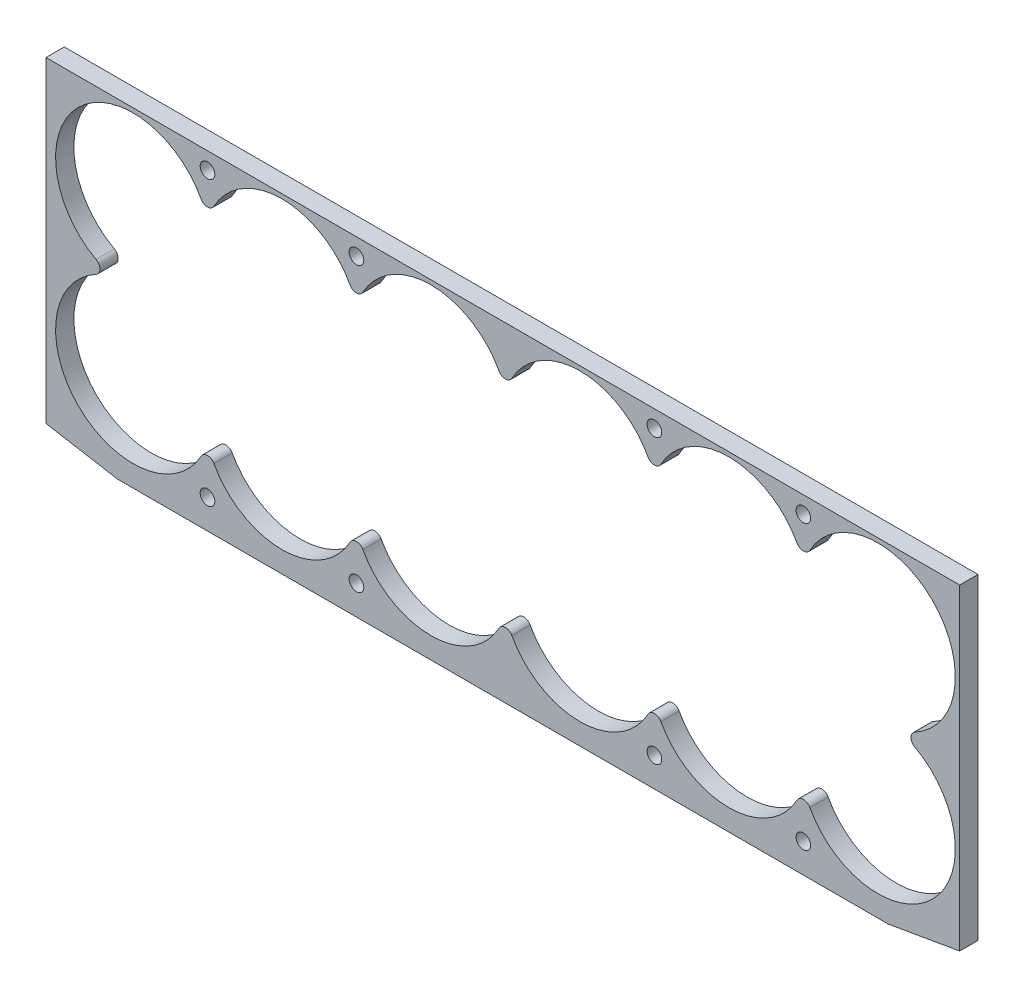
ISO-10303-21;
HEADER;
FILE_DESCRIPTION(('STEP AP214'),'2;1');
FILE_NAME('part.step','',(''),(''),'','','');
FILE_SCHEMA(('AUTOMOTIVE_DESIGN { 1 0 10303 214 1 1 1 1 }'));
ENDSEC;
DATA;
#1=APPLICATION_CONTEXT('core data for automotive mechanical design processes');
#2=APPLICATION_PROTOCOL_DEFINITION('international standard','automotive_design',2000,#1);
#3=PRODUCT_CONTEXT('',#1,'mechanical');
#4=PRODUCT('Part','Part','',(#3));
#5=PRODUCT_RELATED_PRODUCT_CATEGORY('part','',(#4));
#6=PRODUCT_DEFINITION_FORMATION('','',#4);
#7=PRODUCT_DEFINITION_CONTEXT('part definition',#1,'design');
#8=PRODUCT_DEFINITION('design','',#6,#7);
#9=PRODUCT_DEFINITION_SHAPE('','',#8);
#10=(LENGTH_UNIT() NAMED_UNIT(*) SI_UNIT(.MILLI.,.METRE.));
#11=(NAMED_UNIT(*) PLANE_ANGLE_UNIT() SI_UNIT($,.RADIAN.));
#12=(NAMED_UNIT(*) SI_UNIT($,.STERADIAN.) SOLID_ANGLE_UNIT());
#13=UNCERTAINTY_MEASURE_WITH_UNIT(LENGTH_MEASURE(1.E-05),#10,'distance_accuracy_value','');
#14=(GEOMETRIC_REPRESENTATION_CONTEXT(3) GLOBAL_UNCERTAINTY_ASSIGNED_CONTEXT((#13)) GLOBAL_UNIT_ASSIGNED_CONTEXT((#10,
#11,#12)) REPRESENTATION_CONTEXT('',''));
#15=CARTESIAN_POINT('',(0.,0.,0.));
#16=DIRECTION('',(0.,0.,1.));
#17=DIRECTION('',(1.,0.,0.));
#18=AXIS2_PLACEMENT_3D('',#15,#16,#17);
#19=CARTESIAN_POINT('',(0.,0.,3.175));
#20=DIRECTION('',(0.,0.,-1.));
#21=DIRECTION('',(-1.,0.,0.));
#22=AXIS2_PLACEMENT_3D('',#19,#20,#21);
#23=PLANE('',#22);
#24=CARTESIAN_POINT('',(-129.25,-1.66260446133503,3.175));
#25=DIRECTION('',(0.,0.,1.));
#26=DIRECTION('',(1.,0.,0.));
#27=AXIS2_PLACEMENT_3D('',#24,#25,#26);
#28=CIRCLE('',#27,1.27);
#29=CARTESIAN_POINT('',(-127.98,-1.66260446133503,3.175));
#30=VERTEX_POINT('',#29);
#31=EDGE_CURVE('E400',#30,#30,#28,.T.);
#32=ORIENTED_EDGE('',*,*,#31,.F.);
#33=EDGE_LOOP('',(#32));
#34=FACE_BOUND('',#33,.T.);
#35=CARTESIAN_POINT('',(-51.7,-1.66260446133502,3.175));
#36=DIRECTION('',(0.,0.,1.));
#37=DIRECTION('',(1.,0.,0.));
#38=AXIS2_PLACEMENT_3D('',#35,#36,#37);
#39=CIRCLE('',#38,1.27);
#40=CARTESIAN_POINT('',(-50.43,-1.66260446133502,3.175));
#41=VERTEX_POINT('',#40);
#42=EDGE_CURVE('E414',#41,#41,#39,.T.);
#43=ORIENTED_EDGE('',*,*,#42,.F.);
#44=EDGE_LOOP('',(#43));
#45=FACE_BOUND('',#44,.T.);
#46=CARTESIAN_POINT('',(-129.25,-50.8,3.175));
#47=DIRECTION('',(0.,0.,1.));
#48=DIRECTION('',(1.,0.,0.));
#49=AXIS2_PLACEMENT_3D('',#46,#47,#48);
#50=CIRCLE('',#49,1.27);
#51=CARTESIAN_POINT('',(-127.98,-50.8,3.175));
#52=VERTEX_POINT('',#51);
#53=EDGE_CURVE('E426',#52,#52,#50,.T.);
#54=ORIENTED_EDGE('',*,*,#53,.F.);
#55=EDGE_LOOP('',(#54));
#56=FACE_BOUND('',#55,.T.);
#57=CARTESIAN_POINT('',(-51.7,-50.8,3.175));
#58=DIRECTION('',(0.,0.,1.));
#59=DIRECTION('',(1.,0.,0.));
#60=AXIS2_PLACEMENT_3D('',#57,#58,#59);
#61=CIRCLE('',#60,1.27);
#62=CARTESIAN_POINT('',(-50.43,-50.8,3.175));
#63=VERTEX_POINT('',#62);
#64=EDGE_CURVE('E438',#63,#63,#61,.T.);
#65=ORIENTED_EDGE('',*,*,#64,.F.);
#66=EDGE_LOOP('',(#65));
#67=FACE_BOUND('',#66,.T.);
#68=DIRECTION('',(-1.,0.,0.));
#69=VECTOR('',#68,1.);
#70=CARTESIAN_POINT('',(-157.27,1.27,3.175));
#71=LINE('',#70,#69);
#72=CARTESIAN_POINT('',(1.27,1.27,3.175));
#73=VERTEX_POINT('',#72);
#74=CARTESIAN_POINT('',(-157.27,1.27,3.175));
#75=VERTEX_POINT('',#74);
#76=EDGE_CURVE('E242',#73,#75,#71,.T.);
#77=ORIENTED_EDGE('',*,*,#76,.T.);
#78=DIRECTION('',(0.,-1.,0.));
#79=VECTOR('',#78,1.);
#80=CARTESIAN_POINT('',(-157.27,-53.732604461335,3.175));
#81=LINE('',#80,#79);
#82=CARTESIAN_POINT('',(-157.27,-53.732604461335,3.175));
#83=VERTEX_POINT('',#82);
#84=EDGE_CURVE('E231',#75,#83,#81,.T.);
#85=ORIENTED_EDGE('',*,*,#84,.T.);
#86=DIRECTION('',(0.985397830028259,-0.170267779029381,0.));
#87=VECTOR('',#86,1.);
#88=CARTESIAN_POINT('',(-144.842288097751,-55.88,3.175));
#89=LINE('',#88,#87);
#90=CARTESIAN_POINT('',(-144.842288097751,-55.88,3.175));
#91=VERTEX_POINT('',#90);
#92=EDGE_CURVE('E241',#83,#91,#89,.T.);
#93=ORIENTED_EDGE('',*,*,#92,.T.);
#94=DIRECTION('',(1.,0.,0.));
#95=VECTOR('',#94,1.);
#96=CARTESIAN_POINT('',(-11.1577119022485,-55.88,3.175));
#97=LINE('',#96,#95);
#98=CARTESIAN_POINT('',(-11.1577119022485,-55.88,3.175));
#99=VERTEX_POINT('',#98);
#100=EDGE_CURVE('E450',#91,#99,#97,.T.);
#101=ORIENTED_EDGE('',*,*,#100,.T.);
#102=DIRECTION('',(0.985397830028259,0.17026777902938,0.));
#103=VECTOR('',#102,1.);
#104=CARTESIAN_POINT('',(1.27,-53.732604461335,3.175));
#105=LINE('',#104,#103);
#106=CARTESIAN_POINT('',(1.27,-53.732604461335,3.175));
#107=VERTEX_POINT('',#106);
#108=EDGE_CURVE('E452',#99,#107,#105,.T.);
#109=ORIENTED_EDGE('',*,*,#108,.T.);
#110=DIRECTION('',(0.,1.,0.));
#111=VECTOR('',#110,1.);
#112=CARTESIAN_POINT('',(1.27,1.27,3.175));
#113=LINE('',#112,#111);
#114=EDGE_CURVE('E247',#107,#73,#113,.T.);
#115=ORIENTED_EDGE('',*,*,#114,.T.);
#116=EDGE_LOOP('',(#77,#85,#93,#101,#109,#115));
#117=FACE_BOUND('',#116,.T.);
#118=CARTESIAN_POINT('',(-25.85,-50.8,3.175));
#119=DIRECTION('',(0.,0.,1.));
#120=DIRECTION('',(1.,0.,0.));
#121=AXIS2_PLACEMENT_3D('',#118,#119,#120);
#122=CIRCLE('',#121,1.27);
#123=CARTESIAN_POINT('',(-24.58,-50.8,3.175));
#124=VERTEX_POINT('',#123);
#125=EDGE_CURVE('E444',#124,#124,#122,.T.);
#126=ORIENTED_EDGE('',*,*,#125,.F.);
#127=EDGE_LOOP('',(#126));
#128=FACE_BOUND('',#127,.T.);
#129=CARTESIAN_POINT('',(-103.4,-50.8,3.175));
#130=DIRECTION('',(0.,0.,1.));
#131=DIRECTION('',(1.,0.,0.));
#132=AXIS2_PLACEMENT_3D('',#129,#130,#131);
#133=CIRCLE('',#132,1.26999999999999);
#134=CARTESIAN_POINT('',(-102.13,-50.8,3.175));
#135=VERTEX_POINT('',#134);
#136=EDGE_CURVE('E432',#135,#135,#133,.T.);
#137=ORIENTED_EDGE('',*,*,#136,.F.);
#138=EDGE_LOOP('',(#137));
#139=FACE_BOUND('',#138,.T.);
#140=CARTESIAN_POINT('',(-25.85,-1.66260446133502,3.175));
#141=DIRECTION('',(0.,0.,1.));
#142=DIRECTION('',(1.,0.,0.));
#143=AXIS2_PLACEMENT_3D('',#140,#141,#142);
#144=CIRCLE('',#143,1.27);
#145=CARTESIAN_POINT('',(-24.58,-1.66260446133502,3.175));
#146=VERTEX_POINT('',#145);
#147=EDGE_CURVE('E420',#146,#146,#144,.T.);
#148=ORIENTED_EDGE('',*,*,#147,.F.);
#149=EDGE_LOOP('',(#148));
#150=FACE_BOUND('',#149,.T.);
#151=CARTESIAN_POINT('',(-103.4,-1.66260446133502,3.175));
#152=DIRECTION('',(0.,0.,1.));
#153=DIRECTION('',(1.,0.,0.));
#154=AXIS2_PLACEMENT_3D('',#151,#152,#153);
#155=CIRCLE('',#154,1.26999999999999);
#156=CARTESIAN_POINT('',(-102.13,-1.66260446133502,3.175));
#157=VERTEX_POINT('',#156);
#158=EDGE_CURVE('E408',#157,#157,#155,.T.);
#159=ORIENTED_EDGE('',*,*,#158,.F.);
#160=EDGE_LOOP('',(#159));
#161=FACE_BOUND('',#160,.T.);
#162=CARTESIAN_POINT('',(-12.925,-12.925,3.175));
#163=DIRECTION('',(0.,0.,1.));
#164=DIRECTION('',(1.,0.,0.));
#165=AXIS2_PLACEMENT_3D('',#162,#163,#164);
#166=CIRCLE('',#165,13.433);
#167=CARTESIAN_POINT('',(-6.52164382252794,-24.7335781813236,3.175));
#168=VERTEX_POINT('',#167);
#169=CARTESIAN_POINT('',(-24.7335781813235,-6.52164382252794,3.175));
#170=VERTEX_POINT('',#169);
#171=EDGE_CURVE('E881',#168,#170,#166,.T.);
#172=ORIENTED_EDGE('',*,*,#171,.F.);
#173=CARTESIAN_POINT('',(-5.91624946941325,-25.85,3.175));
#174=DIRECTION('',(0.,0.,-1.));
#175=DIRECTION('',(-1.,0.,0.));
#176=AXIS2_PLACEMENT_3D('',#173,#174,#175);
#177=CIRCLE('',#176,1.27);
#178=CARTESIAN_POINT('',(-6.52164382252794,-26.9664218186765,3.175));
#179=VERTEX_POINT('',#178);
#180=EDGE_CURVE('E316',#168,#179,#177,.F.);
#181=ORIENTED_EDGE('',*,*,#180,.T.);
#182=CARTESIAN_POINT('',(-12.925,-38.775,3.175));
#183=DIRECTION('',(0.,0.,1.));
#184=DIRECTION('',(1.,0.,0.));
#185=AXIS2_PLACEMENT_3D('',#182,#183,#184);
#186=CIRCLE('',#185,13.433);
#187=CARTESIAN_POINT('',(-24.7335781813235,-45.1783561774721,3.175));
#188=VERTEX_POINT('',#187);
#189=EDGE_CURVE('E878',#188,#179,#186,.T.);
#190=ORIENTED_EDGE('',*,*,#189,.F.);
#191=CARTESIAN_POINT('',(-25.85,-45.7837505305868,3.175));
#192=DIRECTION('',(0.,0.,-1.));
#193=DIRECTION('',(-1.,0.,0.));
#194=AXIS2_PLACEMENT_3D('',#191,#192,#193);
#195=CIRCLE('',#194,1.27);
#196=CARTESIAN_POINT('',(-26.9664218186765,-45.1783561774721,3.175));
#197=VERTEX_POINT('',#196);
#198=EDGE_CURVE('E295',#188,#197,#195,.F.);
#199=ORIENTED_EDGE('',*,*,#198,.T.);
#200=CARTESIAN_POINT('',(-38.775,-38.775,3.175));
#201=DIRECTION('',(0.,0.,1.));
#202=DIRECTION('',(1.,0.,0.));
#203=AXIS2_PLACEMENT_3D('',#200,#201,#202);
#204=CIRCLE('',#203,13.433);
#205=CARTESIAN_POINT('',(-50.5835781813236,-45.1783561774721,3.175));
#206=VERTEX_POINT('',#205);
#207=EDGE_CURVE('E371',#206,#197,#204,.T.);
#208=ORIENTED_EDGE('',*,*,#207,.F.);
#209=CARTESIAN_POINT('',(-51.7,-45.7837505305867,3.175));
#210=DIRECTION('',(0.,0.,-1.));
#211=DIRECTION('',(-1.,0.,0.));
#212=AXIS2_PLACEMENT_3D('',#209,#210,#211);
#213=CIRCLE('',#212,1.27);
#214=CARTESIAN_POINT('',(-52.8164218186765,-45.1783561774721,3.175));
#215=VERTEX_POINT('',#214);
#216=EDGE_CURVE('E297',#206,#215,#213,.F.);
#217=ORIENTED_EDGE('',*,*,#216,.T.);
#218=CARTESIAN_POINT('',(-64.625,-38.775,3.175));
#219=DIRECTION('',(0.,0.,1.));
#220=DIRECTION('',(1.,0.,0.));
#221=AXIS2_PLACEMENT_3D('',#218,#219,#220);
#222=CIRCLE('',#221,13.433);
#223=CARTESIAN_POINT('',(-76.4335781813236,-45.1783561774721,3.175));
#224=VERTEX_POINT('',#223);
#225=EDGE_CURVE('E886',#224,#215,#222,.T.);
#226=ORIENTED_EDGE('',*,*,#225,.F.);
#227=CARTESIAN_POINT('',(-77.55,-45.7837505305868,3.175));
#228=DIRECTION('',(0.,0.,-1.));
#229=DIRECTION('',(-1.,0.,0.));
#230=AXIS2_PLACEMENT_3D('',#227,#228,#229);
#231=CIRCLE('',#230,1.27);
#232=CARTESIAN_POINT('',(-78.6664218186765,-45.1783561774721,3.175));
#233=VERTEX_POINT('',#232);
#234=EDGE_CURVE('E299',#224,#233,#231,.F.);
#235=ORIENTED_EDGE('',*,*,#234,.T.);
#236=CARTESIAN_POINT('',(-90.475,-38.775,3.175));
#237=DIRECTION('',(0.,0.,1.));
#238=DIRECTION('',(1.,0.,0.));
#239=AXIS2_PLACEMENT_3D('',#236,#237,#238);
#240=CIRCLE('',#239,13.433);
#241=CARTESIAN_POINT('',(-102.283578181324,-45.178356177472,3.175));
#242=VERTEX_POINT('',#241);
#243=EDGE_CURVE('E921',#242,#233,#240,.T.);
#244=ORIENTED_EDGE('',*,*,#243,.F.);
#245=CARTESIAN_POINT('',(-103.4,-45.7837505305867,3.175));
#246=DIRECTION('',(0.,0.,-1.));
#247=DIRECTION('',(-1.,0.,0.));
#248=AXIS2_PLACEMENT_3D('',#245,#246,#247);
#249=CIRCLE('',#248,1.27);
#250=CARTESIAN_POINT('',(-104.516421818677,-45.178356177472,3.175));
#251=VERTEX_POINT('',#250);
#252=EDGE_CURVE('E301',#242,#251,#249,.F.);
#253=ORIENTED_EDGE('',*,*,#252,.T.);
#254=CARTESIAN_POINT('',(-116.325,-38.775,3.175));
#255=DIRECTION('',(0.,0.,1.));
#256=DIRECTION('',(1.,0.,0.));
#257=AXIS2_PLACEMENT_3D('',#254,#255,#256);
#258=CIRCLE('',#257,13.433);
#259=CARTESIAN_POINT('',(-128.133578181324,-45.178356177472,3.175));
#260=VERTEX_POINT('',#259);
#261=EDGE_CURVE('E919',#260,#251,#258,.T.);
#262=ORIENTED_EDGE('',*,*,#261,.F.);
#263=CARTESIAN_POINT('',(-129.25,-45.7837505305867,3.175));
#264=DIRECTION('',(0.,0.,-1.));
#265=DIRECTION('',(-1.,0.,0.));
#266=AXIS2_PLACEMENT_3D('',#263,#264,#265);
#267=CIRCLE('',#266,1.27);
#268=CARTESIAN_POINT('',(-130.366421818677,-45.178356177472,3.175));
#269=VERTEX_POINT('',#268);
#270=EDGE_CURVE('E303',#260,#269,#267,.F.);
#271=ORIENTED_EDGE('',*,*,#270,.T.);
#272=CARTESIAN_POINT('',(-142.175,-38.775,3.175));
#273=DIRECTION('',(0.,0.,1.));
#274=DIRECTION('',(1.,0.,0.));
#275=AXIS2_PLACEMENT_3D('',#272,#273,#274);
#276=CIRCLE('',#275,13.433);
#277=CARTESIAN_POINT('',(-148.578356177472,-26.9664218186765,3.175));
#278=VERTEX_POINT('',#277);
#279=EDGE_CURVE('E924',#278,#269,#276,.T.);
#280=ORIENTED_EDGE('',*,*,#279,.F.);
#281=CARTESIAN_POINT('',(-149.183750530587,-25.85,3.175));
#282=DIRECTION('',(0.,0.,-1.));
#283=DIRECTION('',(-1.,0.,0.));
#284=AXIS2_PLACEMENT_3D('',#281,#282,#283);
#285=CIRCLE('',#284,1.27);
#286=CARTESIAN_POINT('',(-148.578356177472,-24.7335781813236,3.175));
#287=VERTEX_POINT('',#286);
#288=EDGE_CURVE('E48',#278,#287,#285,.F.);
#289=ORIENTED_EDGE('',*,*,#288,.T.);
#290=CARTESIAN_POINT('',(-142.175,-12.925,3.175));
#291=DIRECTION('',(0.,0.,1.));
#292=DIRECTION('',(1.,0.,0.));
#293=AXIS2_PLACEMENT_3D('',#290,#291,#292);
#294=CIRCLE('',#293,13.433);
#295=CARTESIAN_POINT('',(-130.366421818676,-6.5216438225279,3.175));
#296=VERTEX_POINT('',#295);
#297=EDGE_CURVE('E928',#296,#287,#294,.T.);
#298=ORIENTED_EDGE('',*,*,#297,.F.);
#299=CARTESIAN_POINT('',(-129.25,-5.91624946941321,3.175));
#300=DIRECTION('',(0.,0.,-1.));
#301=DIRECTION('',(-1.,0.,0.));
#302=AXIS2_PLACEMENT_3D('',#299,#300,#301);
#303=CIRCLE('',#302,1.27);
#304=CARTESIAN_POINT('',(-128.133578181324,-6.52164382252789,3.175));
#305=VERTEX_POINT('',#304);
#306=EDGE_CURVE('E306',#296,#305,#303,.F.);
#307=ORIENTED_EDGE('',*,*,#306,.T.);
#308=CARTESIAN_POINT('',(-116.325,-12.925,3.175));
#309=DIRECTION('',(0.,0.,1.));
#310=DIRECTION('',(1.,0.,0.));
#311=AXIS2_PLACEMENT_3D('',#308,#309,#310);
#312=CIRCLE('',#311,13.433);
#313=CARTESIAN_POINT('',(-104.516421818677,-6.52164382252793,3.175));
#314=VERTEX_POINT('',#313);
#315=EDGE_CURVE('E399',#314,#305,#312,.T.);
#316=ORIENTED_EDGE('',*,*,#315,.F.);
#317=CARTESIAN_POINT('',(-103.4,-5.91624946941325,3.175));
#318=DIRECTION('',(0.,0.,-1.));
#319=DIRECTION('',(-1.,0.,0.));
#320=AXIS2_PLACEMENT_3D('',#317,#318,#319);
#321=CIRCLE('',#320,1.27);
#322=CARTESIAN_POINT('',(-102.283578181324,-6.52164382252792,3.175));
#323=VERTEX_POINT('',#322);
#324=EDGE_CURVE('E308',#314,#323,#321,.F.);
#325=ORIENTED_EDGE('',*,*,#324,.T.);
#326=CARTESIAN_POINT('',(-90.475,-12.925,3.175));
#327=DIRECTION('',(0.,0.,1.));
#328=DIRECTION('',(1.,0.,0.));
#329=AXIS2_PLACEMENT_3D('',#326,#327,#328);
#330=CIRCLE('',#329,13.433);
#331=CARTESIAN_POINT('',(-78.6664218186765,-6.52164382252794,3.175));
#332=VERTEX_POINT('',#331);
#333=EDGE_CURVE('E407',#332,#323,#330,.T.);
#334=ORIENTED_EDGE('',*,*,#333,.F.);
#335=CARTESIAN_POINT('',(-77.55,-5.91624946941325,3.175));
#336=DIRECTION('',(0.,0.,-1.));
#337=DIRECTION('',(-1.,0.,0.));
#338=AXIS2_PLACEMENT_3D('',#335,#336,#337);
#339=CIRCLE('',#338,1.27);
#340=CARTESIAN_POINT('',(-76.4335781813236,-6.52164382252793,3.175));
#341=VERTEX_POINT('',#340);
#342=EDGE_CURVE('E310',#332,#341,#339,.F.);
#343=ORIENTED_EDGE('',*,*,#342,.T.);
#344=CARTESIAN_POINT('',(-64.625,-12.925,3.175));
#345=DIRECTION('',(0.,0.,1.));
#346=DIRECTION('',(1.,0.,0.));
#347=AXIS2_PLACEMENT_3D('',#344,#345,#346);
#348=CIRCLE('',#347,13.433);
#349=CARTESIAN_POINT('',(-52.8164218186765,-6.52164382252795,3.175));
#350=VERTEX_POINT('',#349);
#351=EDGE_CURVE('E892',#350,#341,#348,.T.);
#352=ORIENTED_EDGE('',*,*,#351,.F.);
#353=CARTESIAN_POINT('',(-51.7,-5.91624946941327,3.175));
#354=DIRECTION('',(0.,0.,-1.));
#355=DIRECTION('',(-1.,0.,0.));
#356=AXIS2_PLACEMENT_3D('',#353,#354,#355);
#357=CIRCLE('',#356,1.27);
#358=CARTESIAN_POINT('',(-50.5835781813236,-6.52164382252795,3.175));
#359=VERTEX_POINT('',#358);
#360=EDGE_CURVE('E312',#350,#359,#357,.F.);
#361=ORIENTED_EDGE('',*,*,#360,.T.);
#362=CARTESIAN_POINT('',(-38.775,-12.925,3.175));
#363=DIRECTION('',(0.,0.,1.));
#364=DIRECTION('',(1.,0.,0.));
#365=AXIS2_PLACEMENT_3D('',#362,#363,#364);
#366=CIRCLE('',#365,13.433);
#367=CARTESIAN_POINT('',(-26.9664218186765,-6.52164382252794,3.175));
#368=VERTEX_POINT('',#367);
#369=EDGE_CURVE('E884',#368,#359,#366,.T.);
#370=ORIENTED_EDGE('',*,*,#369,.F.);
#371=CARTESIAN_POINT('',(-25.85,-5.91624946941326,3.175));
#372=DIRECTION('',(0.,0.,-1.));
#373=DIRECTION('',(-1.,0.,0.));
#374=AXIS2_PLACEMENT_3D('',#371,#372,#373);
#375=CIRCLE('',#374,1.27);
#376=EDGE_CURVE('E314',#368,#170,#375,.F.);
#377=ORIENTED_EDGE('',*,*,#376,.T.);
#378=EDGE_LOOP('',(#172,#181,#190,#199,#208,#217,#226,#235,#244,#253,#262,#271,#280,#289,#298,
#307,#316,#325,#334,#343,#352,#361,#370,#377));
#379=FACE_BOUND('',#378,.T.);
#380=ADVANCED_FACE('F33',(#34,#45,#56,#67,#117,#128,#139,#150,#161,#379),#23,.F.);
#381=CARTESIAN_POINT('',(0.,0.,0.));
#382=DIRECTION('',(0.,0.,-1.));
#383=DIRECTION('',(-1.,0.,0.));
#384=AXIS2_PLACEMENT_3D('',#381,#382,#383);
#385=PLANE('',#384);
#386=CARTESIAN_POINT('',(-129.25,-1.66260446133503,0.));
#387=DIRECTION('',(0.,0.,1.));
#388=DIRECTION('',(1.,0.,0.));
#389=AXIS2_PLACEMENT_3D('',#386,#387,#388);
#390=CIRCLE('',#389,1.27);
#391=CARTESIAN_POINT('',(-127.98,-1.66260446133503,0.));
#392=VERTEX_POINT('',#391);
#393=EDGE_CURVE('E404',#392,#392,#390,.T.);
#394=ORIENTED_EDGE('',*,*,#393,.T.);
#395=EDGE_LOOP('',(#394));
#396=FACE_BOUND('',#395,.T.);
#397=CARTESIAN_POINT('',(-51.7,-1.66260446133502,0.));
#398=DIRECTION('',(0.,0.,1.));
#399=DIRECTION('',(1.,0.,0.));
#400=AXIS2_PLACEMENT_3D('',#397,#398,#399);
#401=CIRCLE('',#400,1.27);
#402=CARTESIAN_POINT('',(-50.43,-1.66260446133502,0.));
#403=VERTEX_POINT('',#402);
#404=EDGE_CURVE('E411',#403,#403,#401,.T.);
#405=ORIENTED_EDGE('',*,*,#404,.T.);
#406=EDGE_LOOP('',(#405));
#407=FACE_BOUND('',#406,.T.);
#408=CARTESIAN_POINT('',(-129.25,-50.8,0.));
#409=DIRECTION('',(0.,0.,1.));
#410=DIRECTION('',(1.,0.,0.));
#411=AXIS2_PLACEMENT_3D('',#408,#409,#410);
#412=CIRCLE('',#411,1.27);
#413=CARTESIAN_POINT('',(-127.98,-50.8,0.));
#414=VERTEX_POINT('',#413);
#415=EDGE_CURVE('E423',#414,#414,#412,.T.);
#416=ORIENTED_EDGE('',*,*,#415,.T.);
#417=EDGE_LOOP('',(#416));
#418=FACE_BOUND('',#417,.T.);
#419=CARTESIAN_POINT('',(-51.7,-50.8,0.));
#420=DIRECTION('',(0.,0.,1.));
#421=DIRECTION('',(1.,0.,0.));
#422=AXIS2_PLACEMENT_3D('',#419,#420,#421);
#423=CIRCLE('',#422,1.27);
#424=CARTESIAN_POINT('',(-50.43,-50.8,0.));
#425=VERTEX_POINT('',#424);
#426=EDGE_CURVE('E435',#425,#425,#423,.T.);
#427=ORIENTED_EDGE('',*,*,#426,.T.);
#428=EDGE_LOOP('',(#427));
#429=FACE_BOUND('',#428,.T.);
#430=DIRECTION('',(-1.,0.,0.));
#431=VECTOR('',#430,1.);
#432=CARTESIAN_POINT('',(-157.27,1.27,0.));
#433=LINE('',#432,#431);
#434=CARTESIAN_POINT('',(1.27,1.27,0.));
#435=VERTEX_POINT('',#434);
#436=CARTESIAN_POINT('',(-157.27,1.27,0.));
#437=VERTEX_POINT('',#436);
#438=EDGE_CURVE('E255',#435,#437,#433,.T.);
#439=ORIENTED_EDGE('',*,*,#438,.F.);
#440=DIRECTION('',(0.,1.,0.));
#441=VECTOR('',#440,1.);
#442=CARTESIAN_POINT('',(1.27,1.27,0.));
#443=LINE('',#442,#441);
#444=CARTESIAN_POINT('',(1.27,-53.732604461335,0.));
#445=VERTEX_POINT('',#444);
#446=EDGE_CURVE('E251',#445,#435,#443,.T.);
#447=ORIENTED_EDGE('',*,*,#446,.F.);
#448=DIRECTION('',(0.985397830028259,0.17026777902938,0.));
#449=VECTOR('',#448,1.);
#450=CARTESIAN_POINT('',(1.27,-53.732604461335,0.));
#451=LINE('',#450,#449);
#452=CARTESIAN_POINT('',(-11.1577119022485,-55.88,0.));
#453=VERTEX_POINT('',#452);
#454=EDGE_CURVE('E463',#453,#445,#451,.T.);
#455=ORIENTED_EDGE('',*,*,#454,.F.);
#456=DIRECTION('',(1.,0.,0.));
#457=VECTOR('',#456,1.);
#458=CARTESIAN_POINT('',(-11.1577119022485,-55.88,0.));
#459=LINE('',#458,#457);
#460=CARTESIAN_POINT('',(-144.842288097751,-55.88,0.));
#461=VERTEX_POINT('',#460);
#462=EDGE_CURVE('E461',#461,#453,#459,.T.);
#463=ORIENTED_EDGE('',*,*,#462,.F.);
#464=DIRECTION('',(0.985397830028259,-0.170267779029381,0.));
#465=VECTOR('',#464,1.);
#466=CARTESIAN_POINT('',(-144.842288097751,-55.88,0.));
#467=LINE('',#466,#465);
#468=CARTESIAN_POINT('',(-157.27,-53.732604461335,0.));
#469=VERTEX_POINT('',#468);
#470=EDGE_CURVE('E459',#469,#461,#467,.T.);
#471=ORIENTED_EDGE('',*,*,#470,.F.);
#472=DIRECTION('',(0.,-1.,0.));
#473=VECTOR('',#472,1.);
#474=CARTESIAN_POINT('',(-157.27,-53.732604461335,0.));
#475=LINE('',#474,#473);
#476=EDGE_CURVE('E457',#437,#469,#475,.T.);
#477=ORIENTED_EDGE('',*,*,#476,.F.);
#478=EDGE_LOOP('',(#439,#447,#455,#463,#471,#477));
#479=FACE_BOUND('',#478,.T.);
#480=CARTESIAN_POINT('',(-25.85,-50.8,0.));
#481=DIRECTION('',(0.,0.,1.));
#482=DIRECTION('',(1.,0.,0.));
#483=AXIS2_PLACEMENT_3D('',#480,#481,#482);
#484=CIRCLE('',#483,1.27);
#485=CARTESIAN_POINT('',(-24.58,-50.8,0.));
#486=VERTEX_POINT('',#485);
#487=EDGE_CURVE('E441',#486,#486,#484,.T.);
#488=ORIENTED_EDGE('',*,*,#487,.T.);
#489=EDGE_LOOP('',(#488));
#490=FACE_BOUND('',#489,.T.);
#491=CARTESIAN_POINT('',(-103.4,-50.8,0.));
#492=DIRECTION('',(0.,0.,1.));
#493=DIRECTION('',(1.,0.,0.));
#494=AXIS2_PLACEMENT_3D('',#491,#492,#493);
#495=CIRCLE('',#494,1.26999999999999);
#496=CARTESIAN_POINT('',(-102.13,-50.8,0.));
#497=VERTEX_POINT('',#496);
#498=EDGE_CURVE('E429',#497,#497,#495,.T.);
#499=ORIENTED_EDGE('',*,*,#498,.T.);
#500=EDGE_LOOP('',(#499));
#501=FACE_BOUND('',#500,.T.);
#502=CARTESIAN_POINT('',(-25.85,-1.66260446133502,0.));
#503=DIRECTION('',(0.,0.,1.));
#504=DIRECTION('',(1.,0.,0.));
#505=AXIS2_PLACEMENT_3D('',#502,#503,#504);
#506=CIRCLE('',#505,1.27);
#507=CARTESIAN_POINT('',(-24.58,-1.66260446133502,0.));
#508=VERTEX_POINT('',#507);
#509=EDGE_CURVE('E417',#508,#508,#506,.T.);
#510=ORIENTED_EDGE('',*,*,#509,.T.);
#511=EDGE_LOOP('',(#510));
#512=FACE_BOUND('',#511,.T.);
#513=CARTESIAN_POINT('',(-103.4,-1.66260446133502,0.));
#514=DIRECTION('',(0.,0.,1.));
#515=DIRECTION('',(1.,0.,0.));
#516=AXIS2_PLACEMENT_3D('',#513,#514,#515);
#517=CIRCLE('',#516,1.26999999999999);
#518=CARTESIAN_POINT('',(-102.13,-1.66260446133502,0.));
#519=VERTEX_POINT('',#518);
#520=EDGE_CURVE('E403',#519,#519,#517,.T.);
#521=ORIENTED_EDGE('',*,*,#520,.T.);
#522=EDGE_LOOP('',(#521));
#523=FACE_BOUND('',#522,.T.);
#524=CARTESIAN_POINT('',(-12.925,-38.775,0.));
#525=DIRECTION('',(0.,0.,1.));
#526=DIRECTION('',(1.,0.,0.));
#527=AXIS2_PLACEMENT_3D('',#524,#525,#526);
#528=CIRCLE('',#527,13.433);
#529=CARTESIAN_POINT('',(-24.7335781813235,-45.1783561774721,0.));
#530=VERTEX_POINT('',#529);
#531=CARTESIAN_POINT('',(-6.52164382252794,-26.9664218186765,0.));
#532=VERTEX_POINT('',#531);
#533=EDGE_CURVE('E379',#530,#532,#528,.T.);
#534=ORIENTED_EDGE('',*,*,#533,.T.);
#535=CARTESIAN_POINT('',(-5.91624946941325,-25.85,0.));
#536=DIRECTION('',(0.,0.,-1.));
#537=DIRECTION('',(-1.,0.,0.));
#538=AXIS2_PLACEMENT_3D('',#535,#536,#537);
#539=CIRCLE('',#538,1.27);
#540=CARTESIAN_POINT('',(-6.52164382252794,-24.7335781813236,0.));
#541=VERTEX_POINT('',#540);
#542=EDGE_CURVE('E288',#532,#541,#539,.T.);
#543=ORIENTED_EDGE('',*,*,#542,.T.);
#544=CARTESIAN_POINT('',(-12.925,-12.925,0.));
#545=DIRECTION('',(0.,0.,1.));
#546=DIRECTION('',(1.,0.,0.));
#547=AXIS2_PLACEMENT_3D('',#544,#545,#546);
#548=CIRCLE('',#547,13.433);
#549=CARTESIAN_POINT('',(-24.7335781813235,-6.52164382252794,0.));
#550=VERTEX_POINT('',#549);
#551=EDGE_CURVE('E382',#541,#550,#548,.T.);
#552=ORIENTED_EDGE('',*,*,#551,.T.);
#553=CARTESIAN_POINT('',(-25.85,-5.91624946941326,0.));
#554=DIRECTION('',(0.,0.,-1.));
#555=DIRECTION('',(-1.,0.,0.));
#556=AXIS2_PLACEMENT_3D('',#553,#554,#555);
#557=CIRCLE('',#556,1.27);
#558=CARTESIAN_POINT('',(-26.9664218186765,-6.52164382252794,0.));
#559=VERTEX_POINT('',#558);
#560=EDGE_CURVE('E286',#550,#559,#557,.T.);
#561=ORIENTED_EDGE('',*,*,#560,.T.);
#562=CARTESIAN_POINT('',(-38.775,-12.925,0.));
#563=DIRECTION('',(0.,0.,1.));
#564=DIRECTION('',(1.,0.,0.));
#565=AXIS2_PLACEMENT_3D('',#562,#563,#564);
#566=CIRCLE('',#565,13.433);
#567=CARTESIAN_POINT('',(-50.5835781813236,-6.52164382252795,0.));
#568=VERTEX_POINT('',#567);
#569=EDGE_CURVE('E390',#559,#568,#566,.T.);
#570=ORIENTED_EDGE('',*,*,#569,.T.);
#571=CARTESIAN_POINT('',(-51.7,-5.91624946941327,0.));
#572=DIRECTION('',(0.,0.,-1.));
#573=DIRECTION('',(-1.,0.,0.));
#574=AXIS2_PLACEMENT_3D('',#571,#572,#573);
#575=CIRCLE('',#574,1.27);
#576=CARTESIAN_POINT('',(-52.8164218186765,-6.52164382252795,0.));
#577=VERTEX_POINT('',#576);
#578=EDGE_CURVE('E284',#568,#577,#575,.T.);
#579=ORIENTED_EDGE('',*,*,#578,.T.);
#580=CARTESIAN_POINT('',(-64.625,-12.925,0.));
#581=DIRECTION('',(0.,0.,1.));
#582=DIRECTION('',(1.,0.,0.));
#583=AXIS2_PLACEMENT_3D('',#580,#581,#582);
#584=CIRCLE('',#583,13.433);
#585=CARTESIAN_POINT('',(-76.4335781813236,-6.52164382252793,0.));
#586=VERTEX_POINT('',#585);
#587=EDGE_CURVE('E393',#577,#586,#584,.T.);
#588=ORIENTED_EDGE('',*,*,#587,.T.);
#589=CARTESIAN_POINT('',(-77.55,-5.91624946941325,0.));
#590=DIRECTION('',(0.,0.,-1.));
#591=DIRECTION('',(-1.,0.,0.));
#592=AXIS2_PLACEMENT_3D('',#589,#590,#591);
#593=CIRCLE('',#592,1.27);
#594=CARTESIAN_POINT('',(-78.6664218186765,-6.52164382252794,0.));
#595=VERTEX_POINT('',#594);
#596=EDGE_CURVE('E282',#586,#595,#593,.T.);
#597=ORIENTED_EDGE('',*,*,#596,.T.);
#598=CARTESIAN_POINT('',(-90.475,-12.925,0.));
#599=DIRECTION('',(0.,0.,1.));
#600=DIRECTION('',(1.,0.,0.));
#601=AXIS2_PLACEMENT_3D('',#598,#599,#600);
#602=CIRCLE('',#601,13.433);
#603=CARTESIAN_POINT('',(-102.283578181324,-6.52164382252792,0.));
#604=VERTEX_POINT('',#603);
#605=EDGE_CURVE('E396',#595,#604,#602,.T.);
#606=ORIENTED_EDGE('',*,*,#605,.T.);
#607=CARTESIAN_POINT('',(-103.4,-5.91624946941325,0.));
#608=DIRECTION('',(0.,0.,-1.));
#609=DIRECTION('',(-1.,0.,0.));
#610=AXIS2_PLACEMENT_3D('',#607,#608,#609);
#611=CIRCLE('',#610,1.27);
#612=CARTESIAN_POINT('',(-104.516421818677,-6.52164382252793,0.));
#613=VERTEX_POINT('',#612);
#614=EDGE_CURVE('E280',#604,#613,#611,.T.);
#615=ORIENTED_EDGE('',*,*,#614,.T.);
#616=CARTESIAN_POINT('',(-116.325,-12.925,0.));
#617=DIRECTION('',(0.,0.,1.));
#618=DIRECTION('',(1.,0.,0.));
#619=AXIS2_PLACEMENT_3D('',#616,#617,#618);
#620=CIRCLE('',#619,13.433);
#621=CARTESIAN_POINT('',(-128.133578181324,-6.52164382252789,0.));
#622=VERTEX_POINT('',#621);
#623=EDGE_CURVE('E897',#613,#622,#620,.T.);
#624=ORIENTED_EDGE('',*,*,#623,.T.);
#625=CARTESIAN_POINT('',(-129.25,-5.91624946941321,0.));
#626=DIRECTION('',(0.,0.,-1.));
#627=DIRECTION('',(-1.,0.,0.));
#628=AXIS2_PLACEMENT_3D('',#625,#626,#627);
#629=CIRCLE('',#628,1.27);
#630=CARTESIAN_POINT('',(-130.366421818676,-6.5216438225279,0.));
#631=VERTEX_POINT('',#630);
#632=EDGE_CURVE('E278',#622,#631,#629,.T.);
#633=ORIENTED_EDGE('',*,*,#632,.T.);
#634=CARTESIAN_POINT('',(-142.175,-12.925,0.));
#635=DIRECTION('',(0.,0.,1.));
#636=DIRECTION('',(1.,0.,0.));
#637=AXIS2_PLACEMENT_3D('',#634,#635,#636);
#638=CIRCLE('',#637,13.433);
#639=CARTESIAN_POINT('',(-148.578356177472,-24.7335781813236,0.));
#640=VERTEX_POINT('',#639);
#641=EDGE_CURVE('E900',#631,#640,#638,.T.);
#642=ORIENTED_EDGE('',*,*,#641,.T.);
#643=CARTESIAN_POINT('',(-149.183750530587,-25.85,0.));
#644=DIRECTION('',(0.,0.,-1.));
#645=DIRECTION('',(-1.,0.,0.));
#646=AXIS2_PLACEMENT_3D('',#643,#644,#645);
#647=CIRCLE('',#646,1.27);
#648=CARTESIAN_POINT('',(-148.578356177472,-26.9664218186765,0.));
#649=VERTEX_POINT('',#648);
#650=EDGE_CURVE('E276',#640,#649,#647,.T.);
#651=ORIENTED_EDGE('',*,*,#650,.T.);
#652=CARTESIAN_POINT('',(-142.175,-38.775,0.));
#653=DIRECTION('',(0.,0.,1.));
#654=DIRECTION('',(1.,0.,0.));
#655=AXIS2_PLACEMENT_3D('',#652,#653,#654);
#656=CIRCLE('',#655,13.433);
#657=CARTESIAN_POINT('',(-130.366421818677,-45.178356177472,0.));
#658=VERTEX_POINT('',#657);
#659=EDGE_CURVE('E903',#649,#658,#656,.T.);
#660=ORIENTED_EDGE('',*,*,#659,.T.);
#661=CARTESIAN_POINT('',(-129.25,-45.7837505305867,0.));
#662=DIRECTION('',(0.,0.,-1.));
#663=DIRECTION('',(-1.,0.,0.));
#664=AXIS2_PLACEMENT_3D('',#661,#662,#663);
#665=CIRCLE('',#664,1.27);
#666=CARTESIAN_POINT('',(-128.133578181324,-45.178356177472,0.));
#667=VERTEX_POINT('',#666);
#668=EDGE_CURVE('E274',#658,#667,#665,.T.);
#669=ORIENTED_EDGE('',*,*,#668,.T.);
#670=CARTESIAN_POINT('',(-116.325,-38.775,0.));
#671=DIRECTION('',(0.,0.,1.));
#672=DIRECTION('',(1.,0.,0.));
#673=AXIS2_PLACEMENT_3D('',#670,#671,#672);
#674=CIRCLE('',#673,13.433);
#675=CARTESIAN_POINT('',(-104.516421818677,-45.178356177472,0.));
#676=VERTEX_POINT('',#675);
#677=EDGE_CURVE('E906',#667,#676,#674,.T.);
#678=ORIENTED_EDGE('',*,*,#677,.T.);
#679=CARTESIAN_POINT('',(-103.4,-45.7837505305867,0.));
#680=DIRECTION('',(0.,0.,-1.));
#681=DIRECTION('',(-1.,0.,0.));
#682=AXIS2_PLACEMENT_3D('',#679,#680,#681);
#683=CIRCLE('',#682,1.27);
#684=CARTESIAN_POINT('',(-102.283578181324,-45.178356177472,0.));
#685=VERTEX_POINT('',#684);
#686=EDGE_CURVE('E272',#676,#685,#683,.T.);
#687=ORIENTED_EDGE('',*,*,#686,.T.);
#688=CARTESIAN_POINT('',(-90.475,-38.775,0.));
#689=DIRECTION('',(0.,0.,1.));
#690=DIRECTION('',(1.,0.,0.));
#691=AXIS2_PLACEMENT_3D('',#688,#689,#690);
#692=CIRCLE('',#691,13.433);
#693=CARTESIAN_POINT('',(-78.6664218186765,-45.1783561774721,0.));
#694=VERTEX_POINT('',#693);
#695=EDGE_CURVE('E384',#685,#694,#692,.T.);
#696=ORIENTED_EDGE('',*,*,#695,.T.);
#697=CARTESIAN_POINT('',(-77.55,-45.7837505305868,0.));
#698=DIRECTION('',(0.,0.,-1.));
#699=DIRECTION('',(-1.,0.,0.));
#700=AXIS2_PLACEMENT_3D('',#697,#698,#699);
#701=CIRCLE('',#700,1.27);
#702=CARTESIAN_POINT('',(-76.4335781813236,-45.1783561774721,0.));
#703=VERTEX_POINT('',#702);
#704=EDGE_CURVE('E270',#694,#703,#701,.T.);
#705=ORIENTED_EDGE('',*,*,#704,.T.);
#706=CARTESIAN_POINT('',(-64.625,-38.775,0.));
#707=DIRECTION('',(0.,0.,1.));
#708=DIRECTION('',(1.,0.,0.));
#709=AXIS2_PLACEMENT_3D('',#706,#707,#708);
#710=CIRCLE('',#709,13.433);
#711=CARTESIAN_POINT('',(-52.8164218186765,-45.1783561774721,0.));
#712=VERTEX_POINT('',#711);
#713=EDGE_CURVE('E380',#703,#712,#710,.T.);
#714=ORIENTED_EDGE('',*,*,#713,.T.);
#715=CARTESIAN_POINT('',(-51.7,-45.7837505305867,0.));
#716=DIRECTION('',(0.,0.,-1.));
#717=DIRECTION('',(-1.,0.,0.));
#718=AXIS2_PLACEMENT_3D('',#715,#716,#717);
#719=CIRCLE('',#718,1.27);
#720=CARTESIAN_POINT('',(-50.5835781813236,-45.1783561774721,0.));
#721=VERTEX_POINT('',#720);
#722=EDGE_CURVE('E268',#712,#721,#719,.T.);
#723=ORIENTED_EDGE('',*,*,#722,.T.);
#724=CARTESIAN_POINT('',(-38.775,-38.775,0.));
#725=DIRECTION('',(0.,0.,1.));
#726=DIRECTION('',(1.,0.,0.));
#727=AXIS2_PLACEMENT_3D('',#724,#725,#726);
#728=CIRCLE('',#727,13.433);
#729=CARTESIAN_POINT('',(-26.9664218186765,-45.1783561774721,0.));
#730=VERTEX_POINT('',#729);
#731=EDGE_CURVE('E368',#721,#730,#728,.T.);
#732=ORIENTED_EDGE('',*,*,#731,.T.);
#733=CARTESIAN_POINT('',(-25.85,-45.7837505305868,0.));
#734=DIRECTION('',(0.,0.,-1.));
#735=DIRECTION('',(-1.,0.,0.));
#736=AXIS2_PLACEMENT_3D('',#733,#734,#735);
#737=CIRCLE('',#736,1.27);
#738=EDGE_CURVE('E266',#730,#530,#737,.T.);
#739=ORIENTED_EDGE('',*,*,#738,.T.);
#740=EDGE_LOOP('',(#534,#543,#552,#561,#570,#579,#588,#597,#606,#615,#624,#633,#642,#651,#660,
#669,#678,#687,#696,#705,#714,#723,#732,#739));
#741=FACE_BOUND('',#740,.T.);
#742=ADVANCED_FACE('F376',(#396,#407,#418,#429,#479,#490,#501,#512,#523,#741),#385,.T.);
#743=CARTESIAN_POINT('',(-157.27,1.27,3.175));
#744=DIRECTION('',(0.,-1.,0.));
#745=DIRECTION('',(0.,0.,-1.));
#746=AXIS2_PLACEMENT_3D('',#743,#744,#745);
#747=PLANE('',#746);
#748=ORIENTED_EDGE('',*,*,#438,.T.);
#749=DIRECTION('',(0.,0.,-1.));
#750=VECTOR('',#749,1.);
#751=CARTESIAN_POINT('',(-157.27,1.27,3.175));
#752=LINE('',#751,#750);
#753=EDGE_CURVE('E235',#75,#437,#752,.T.);
#754=ORIENTED_EDGE('',*,*,#753,.F.);
#755=ORIENTED_EDGE('',*,*,#76,.F.);
#756=DIRECTION('',(0.,0.,-1.));
#757=VECTOR('',#756,1.);
#758=CARTESIAN_POINT('',(1.27,1.27,3.175));
#759=LINE('',#758,#757);
#760=EDGE_CURVE('E455',#73,#435,#759,.T.);
#761=ORIENTED_EDGE('',*,*,#760,.T.);
#762=EDGE_LOOP('',(#748,#754,#755,#761));
#763=FACE_BOUND('',#762,.T.);
#764=ADVANCED_FACE('F253',(#763),#747,.F.);
#765=CARTESIAN_POINT('',(-157.27,-53.732604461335,3.175));
#766=DIRECTION('',(1.,0.,0.));
#767=DIRECTION('',(0.,0.,-1.));
#768=AXIS2_PLACEMENT_3D('',#765,#766,#767);
#769=PLANE('',#768);
#770=ORIENTED_EDGE('',*,*,#476,.T.);
#771=DIRECTION('',(0.,0.,-1.));
#772=VECTOR('',#771,1.);
#773=CARTESIAN_POINT('',(-157.27,-53.732604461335,3.175));
#774=LINE('',#773,#772);
#775=EDGE_CURVE('E238',#83,#469,#774,.T.);
#776=ORIENTED_EDGE('',*,*,#775,.F.);
#777=ORIENTED_EDGE('',*,*,#84,.F.);
#778=ORIENTED_EDGE('',*,*,#753,.T.);
#779=EDGE_LOOP('',(#770,#776,#777,#778));
#780=FACE_BOUND('',#779,.T.);
#781=ADVANCED_FACE('F233',(#780),#769,.F.);
#782=CARTESIAN_POINT('',(-144.842288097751,-55.88,3.175));
#783=DIRECTION('',(0.170267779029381,0.985397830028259,0.));
#784=DIRECTION('',(-0.985397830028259,0.170267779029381,0.));
#785=AXIS2_PLACEMENT_3D('',#782,#783,#784);
#786=PLANE('',#785);
#787=ORIENTED_EDGE('',*,*,#470,.T.);
#788=DIRECTION('',(0.,0.,-1.));
#789=VECTOR('',#788,1.);
#790=CARTESIAN_POINT('',(-144.842288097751,-55.88,3.175));
#791=LINE('',#790,#789);
#792=EDGE_CURVE('E260',#91,#461,#791,.T.);
#793=ORIENTED_EDGE('',*,*,#792,.F.);
#794=ORIENTED_EDGE('',*,*,#92,.F.);
#795=ORIENTED_EDGE('',*,*,#775,.T.);
#796=EDGE_LOOP('',(#787,#793,#794,#795));
#797=FACE_BOUND('',#796,.T.);
#798=ADVANCED_FACE('F491',(#797),#786,.F.);
#799=CARTESIAN_POINT('',(-11.1577119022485,-55.88,3.175));
#800=DIRECTION('',(0.,1.,0.));
#801=DIRECTION('',(0.,0.,1.));
#802=AXIS2_PLACEMENT_3D('',#799,#800,#801);
#803=PLANE('',#802);
#804=ORIENTED_EDGE('',*,*,#462,.T.);
#805=DIRECTION('',(0.,0.,-1.));
#806=VECTOR('',#805,1.);
#807=CARTESIAN_POINT('',(-11.1577119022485,-55.88,3.175));
#808=LINE('',#807,#806);
#809=EDGE_CURVE('E470',#99,#453,#808,.T.);
#810=ORIENTED_EDGE('',*,*,#809,.F.);
#811=ORIENTED_EDGE('',*,*,#100,.F.);
#812=ORIENTED_EDGE('',*,*,#792,.T.);
#813=EDGE_LOOP('',(#804,#810,#811,#812));
#814=FACE_BOUND('',#813,.T.);
#815=ADVANCED_FACE('F477',(#814),#803,.F.);
#816=CARTESIAN_POINT('',(1.27,-53.732604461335,3.175));
#817=DIRECTION('',(-0.17026777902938,0.985397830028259,0.));
#818=DIRECTION('',(-0.985397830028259,-0.17026777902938,0.));
#819=AXIS2_PLACEMENT_3D('',#816,#817,#818);
#820=PLANE('',#819);
#821=ORIENTED_EDGE('',*,*,#454,.T.);
#822=DIRECTION('',(0.,0.,-1.));
#823=VECTOR('',#822,1.);
#824=CARTESIAN_POINT('',(1.27,-53.732604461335,3.175));
#825=LINE('',#824,#823);
#826=EDGE_CURVE('E467',#107,#445,#825,.T.);
#827=ORIENTED_EDGE('',*,*,#826,.F.);
#828=ORIENTED_EDGE('',*,*,#108,.F.);
#829=ORIENTED_EDGE('',*,*,#809,.T.);
#830=EDGE_LOOP('',(#821,#827,#828,#829));
#831=FACE_BOUND('',#830,.T.);
#832=ADVANCED_FACE('F487',(#831),#820,.F.);
#833=CARTESIAN_POINT('',(1.27,1.27,3.175));
#834=DIRECTION('',(-1.,0.,0.));
#835=DIRECTION('',(0.,0.,1.));
#836=AXIS2_PLACEMENT_3D('',#833,#834,#835);
#837=PLANE('',#836);
#838=ORIENTED_EDGE('',*,*,#446,.T.);
#839=ORIENTED_EDGE('',*,*,#760,.F.);
#840=ORIENTED_EDGE('',*,*,#114,.F.);
#841=ORIENTED_EDGE('',*,*,#826,.T.);
#842=EDGE_LOOP('',(#838,#839,#840,#841));
#843=FACE_BOUND('',#842,.T.);
#844=ADVANCED_FACE('F490',(#843),#837,.F.);
#845=CARTESIAN_POINT('',(-25.85,-50.8,3.175));
#846=DIRECTION('',(0.,0.,-1.));
#847=DIRECTION('',(-1.,0.,0.));
#848=AXIS2_PLACEMENT_3D('',#845,#846,#847);
#849=CYLINDRICAL_SURFACE('',#848,1.27);
#850=ORIENTED_EDGE('',*,*,#125,.T.);
#851=EDGE_LOOP('',(#850));
#852=FACE_BOUND('',#851,.T.);
#853=ORIENTED_EDGE('',*,*,#487,.F.);
#854=EDGE_LOOP('',(#853));
#855=FACE_BOUND('',#854,.T.);
#856=ADVANCED_FACE('F511',(#852,#855),#849,.F.);
#857=CARTESIAN_POINT('',(-51.7,-50.8,3.175));
#858=DIRECTION('',(0.,0.,-1.));
#859=DIRECTION('',(-1.,0.,0.));
#860=AXIS2_PLACEMENT_3D('',#857,#858,#859);
#861=CYLINDRICAL_SURFACE('',#860,1.27);
#862=ORIENTED_EDGE('',*,*,#64,.T.);
#863=EDGE_LOOP('',(#862));
#864=FACE_BOUND('',#863,.T.);
#865=ORIENTED_EDGE('',*,*,#426,.F.);
#866=EDGE_LOOP('',(#865));
#867=FACE_BOUND('',#866,.T.);
#868=ADVANCED_FACE('F531',(#864,#867),#861,.F.);
#869=CARTESIAN_POINT('',(-103.4,-50.8,3.175));
#870=DIRECTION('',(0.,0.,-1.));
#871=DIRECTION('',(-1.,0.,0.));
#872=AXIS2_PLACEMENT_3D('',#869,#870,#871);
#873=CYLINDRICAL_SURFACE('',#872,1.26999999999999);
#874=ORIENTED_EDGE('',*,*,#136,.T.);
#875=EDGE_LOOP('',(#874));
#876=FACE_BOUND('',#875,.T.);
#877=ORIENTED_EDGE('',*,*,#498,.F.);
#878=EDGE_LOOP('',(#877));
#879=FACE_BOUND('',#878,.T.);
#880=ADVANCED_FACE('F538',(#876,#879),#873,.F.);
#881=CARTESIAN_POINT('',(-129.25,-50.8,3.175));
#882=DIRECTION('',(0.,0.,-1.));
#883=DIRECTION('',(-1.,0.,0.));
#884=AXIS2_PLACEMENT_3D('',#881,#882,#883);
#885=CYLINDRICAL_SURFACE('',#884,1.27);
#886=ORIENTED_EDGE('',*,*,#53,.T.);
#887=EDGE_LOOP('',(#886));
#888=FACE_BOUND('',#887,.T.);
#889=ORIENTED_EDGE('',*,*,#415,.F.);
#890=EDGE_LOOP('',(#889));
#891=FACE_BOUND('',#890,.T.);
#892=ADVANCED_FACE('F545',(#888,#891),#885,.F.);
#893=CARTESIAN_POINT('',(-25.85,-1.66260446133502,3.175));
#894=DIRECTION('',(0.,0.,-1.));
#895=DIRECTION('',(-1.,0.,0.));
#896=AXIS2_PLACEMENT_3D('',#893,#894,#895);
#897=CYLINDRICAL_SURFACE('',#896,1.27);
#898=ORIENTED_EDGE('',*,*,#147,.T.);
#899=EDGE_LOOP('',(#898));
#900=FACE_BOUND('',#899,.T.);
#901=ORIENTED_EDGE('',*,*,#509,.F.);
#902=EDGE_LOOP('',(#901));
#903=FACE_BOUND('',#902,.T.);
#904=ADVANCED_FACE('F553',(#900,#903),#897,.F.);
#905=CARTESIAN_POINT('',(-51.7,-1.66260446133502,3.175));
#906=DIRECTION('',(0.,0.,-1.));
#907=DIRECTION('',(-1.,0.,0.));
#908=AXIS2_PLACEMENT_3D('',#905,#906,#907);
#909=CYLINDRICAL_SURFACE('',#908,1.27);
#910=ORIENTED_EDGE('',*,*,#42,.T.);
#911=EDGE_LOOP('',(#910));
#912=FACE_BOUND('',#911,.T.);
#913=ORIENTED_EDGE('',*,*,#404,.F.);
#914=EDGE_LOOP('',(#913));
#915=FACE_BOUND('',#914,.T.);
#916=ADVANCED_FACE('F561',(#912,#915),#909,.F.);
#917=CARTESIAN_POINT('',(-103.4,-1.66260446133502,3.175));
#918=DIRECTION('',(0.,0.,-1.));
#919=DIRECTION('',(-1.,0.,0.));
#920=AXIS2_PLACEMENT_3D('',#917,#918,#919);
#921=CYLINDRICAL_SURFACE('',#920,1.26999999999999);
#922=ORIENTED_EDGE('',*,*,#158,.T.);
#923=EDGE_LOOP('',(#922));
#924=FACE_BOUND('',#923,.T.);
#925=ORIENTED_EDGE('',*,*,#520,.F.);
#926=EDGE_LOOP('',(#925));
#927=FACE_BOUND('',#926,.T.);
#928=ADVANCED_FACE('F569',(#924,#927),#921,.F.);
#929=CARTESIAN_POINT('',(-129.25,-1.66260446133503,3.175));
#930=DIRECTION('',(0.,0.,-1.));
#931=DIRECTION('',(-1.,0.,0.));
#932=AXIS2_PLACEMENT_3D('',#929,#930,#931);
#933=CYLINDRICAL_SURFACE('',#932,1.27);
#934=ORIENTED_EDGE('',*,*,#31,.T.);
#935=EDGE_LOOP('',(#934));
#936=FACE_BOUND('',#935,.T.);
#937=ORIENTED_EDGE('',*,*,#393,.F.);
#938=EDGE_LOOP('',(#937));
#939=FACE_BOUND('',#938,.T.);
#940=ADVANCED_FACE('F577',(#936,#939),#933,.F.);
#941=CARTESIAN_POINT('',(-116.325,-12.925,3.175));
#942=DIRECTION('',(0.,0.,-1.));
#943=DIRECTION('',(-1.,0.,0.));
#944=AXIS2_PLACEMENT_3D('',#941,#942,#943);
#945=CYLINDRICAL_SURFACE('',#944,13.433);
#946=ORIENTED_EDGE('',*,*,#623,.F.);
#947=DIRECTION('',(0.,0.,-1.));
#948=VECTOR('',#947,1.);
#949=CARTESIAN_POINT('',(-104.516421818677,-6.52164382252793,3.175));
#950=LINE('',#949,#948);
#951=EDGE_CURVE('E336',#613,#314,#950,.F.);
#952=ORIENTED_EDGE('',*,*,#951,.T.);
#953=ORIENTED_EDGE('',*,*,#315,.T.);
#954=DIRECTION('',(0.,0.,-1.));
#955=VECTOR('',#954,1.);
#956=CARTESIAN_POINT('',(-128.133578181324,-6.52164382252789,3.175));
#957=LINE('',#956,#955);
#958=EDGE_CURVE('E333',#305,#622,#957,.T.);
#959=ORIENTED_EDGE('',*,*,#958,.T.);
#960=EDGE_LOOP('',(#946,#952,#953,#959));
#961=FACE_BOUND('',#960,.T.);
#962=ADVANCED_FACE('F585',(#961),#945,.F.);
#963=CARTESIAN_POINT('',(-142.175,-12.925,3.175));
#964=DIRECTION('',(0.,0.,-1.));
#965=DIRECTION('',(-1.,0.,0.));
#966=AXIS2_PLACEMENT_3D('',#963,#964,#965);
#967=CYLINDRICAL_SURFACE('',#966,13.433);
#968=ORIENTED_EDGE('',*,*,#641,.F.);
#969=DIRECTION('',(0.,0.,-1.));
#970=VECTOR('',#969,1.);
#971=CARTESIAN_POINT('',(-130.366421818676,-6.5216438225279,3.175));
#972=LINE('',#971,#970);
#973=EDGE_CURVE('E55',#631,#296,#972,.F.);
#974=ORIENTED_EDGE('',*,*,#973,.T.);
#975=ORIENTED_EDGE('',*,*,#297,.T.);
#976=DIRECTION('',(0.,0.,-1.));
#977=VECTOR('',#976,1.);
#978=CARTESIAN_POINT('',(-148.578356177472,-24.7335781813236,3.175));
#979=LINE('',#978,#977);
#980=EDGE_CURVE('E338',#287,#640,#979,.T.);
#981=ORIENTED_EDGE('',*,*,#980,.T.);
#982=EDGE_LOOP('',(#968,#974,#975,#981));
#983=FACE_BOUND('',#982,.T.);
#984=ADVANCED_FACE('F593',(#983),#967,.F.);
#985=CARTESIAN_POINT('',(-142.175,-38.775,3.175));
#986=DIRECTION('',(0.,0.,-1.));
#987=DIRECTION('',(-1.,0.,0.));
#988=AXIS2_PLACEMENT_3D('',#985,#986,#987);
#989=CYLINDRICAL_SURFACE('',#988,13.433);
#990=ORIENTED_EDGE('',*,*,#659,.F.);
#991=DIRECTION('',(0.,0.,-1.));
#992=VECTOR('',#991,1.);
#993=CARTESIAN_POINT('',(-148.578356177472,-26.9664218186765,3.175));
#994=LINE('',#993,#992);
#995=EDGE_CURVE('E345',#649,#278,#994,.F.);
#996=ORIENTED_EDGE('',*,*,#995,.T.);
#997=ORIENTED_EDGE('',*,*,#279,.T.);
#998=DIRECTION('',(0.,0.,-1.));
#999=VECTOR('',#998,1.);
#1000=CARTESIAN_POINT('',(-130.366421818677,-45.178356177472,3.175));
#1001=LINE('',#1000,#999);
#1002=EDGE_CURVE('E342',#269,#658,#1001,.T.);
#1003=ORIENTED_EDGE('',*,*,#1002,.T.);
#1004=EDGE_LOOP('',(#990,#996,#997,#1003));
#1005=FACE_BOUND('',#1004,.T.);
#1006=ADVANCED_FACE('F602',(#1005),#989,.F.);
#1007=CARTESIAN_POINT('',(-116.325,-38.775,3.175));
#1008=DIRECTION('',(0.,0.,-1.));
#1009=DIRECTION('',(-1.,0.,0.));
#1010=AXIS2_PLACEMENT_3D('',#1007,#1008,#1009);
#1011=CYLINDRICAL_SURFACE('',#1010,13.433);
#1012=ORIENTED_EDGE('',*,*,#677,.F.);
#1013=DIRECTION('',(0.,0.,-1.));
#1014=VECTOR('',#1013,1.);
#1015=CARTESIAN_POINT('',(-128.133578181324,-45.178356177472,3.175));
#1016=LINE('',#1015,#1014);
#1017=EDGE_CURVE('E350',#667,#260,#1016,.F.);
#1018=ORIENTED_EDGE('',*,*,#1017,.T.);
#1019=ORIENTED_EDGE('',*,*,#261,.T.);
#1020=DIRECTION('',(0.,0.,-1.));
#1021=VECTOR('',#1020,1.);
#1022=CARTESIAN_POINT('',(-104.516421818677,-45.178356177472,3.175));
#1023=LINE('',#1022,#1021);
#1024=EDGE_CURVE('E347',#251,#676,#1023,.T.);
#1025=ORIENTED_EDGE('',*,*,#1024,.T.);
#1026=EDGE_LOOP('',(#1012,#1018,#1019,#1025));
#1027=FACE_BOUND('',#1026,.T.);
#1028=ADVANCED_FACE('F609',(#1027),#1011,.F.);
#1029=CARTESIAN_POINT('',(-90.475,-38.775,3.175));
#1030=DIRECTION('',(0.,0.,-1.));
#1031=DIRECTION('',(-1.,0.,0.));
#1032=AXIS2_PLACEMENT_3D('',#1029,#1030,#1031);
#1033=CYLINDRICAL_SURFACE('',#1032,13.433);
#1034=ORIENTED_EDGE('',*,*,#695,.F.);
#1035=DIRECTION('',(0.,0.,-1.));
#1036=VECTOR('',#1035,1.);
#1037=CARTESIAN_POINT('',(-102.283578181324,-45.178356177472,3.175));
#1038=LINE('',#1037,#1036);
#1039=EDGE_CURVE('E355',#685,#242,#1038,.F.);
#1040=ORIENTED_EDGE('',*,*,#1039,.T.);
#1041=ORIENTED_EDGE('',*,*,#243,.T.);
#1042=DIRECTION('',(0.,0.,-1.));
#1043=VECTOR('',#1042,1.);
#1044=CARTESIAN_POINT('',(-78.6664218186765,-45.1783561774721,3.175));
#1045=LINE('',#1044,#1043);
#1046=EDGE_CURVE('E352',#233,#694,#1045,.T.);
#1047=ORIENTED_EDGE('',*,*,#1046,.T.);
#1048=EDGE_LOOP('',(#1034,#1040,#1041,#1047));
#1049=FACE_BOUND('',#1048,.T.);
#1050=ADVANCED_FACE('F617',(#1049),#1033,.F.);
#1051=CARTESIAN_POINT('',(-64.625,-38.775,3.175));
#1052=DIRECTION('',(0.,0.,-1.));
#1053=DIRECTION('',(-1.,0.,0.));
#1054=AXIS2_PLACEMENT_3D('',#1051,#1052,#1053);
#1055=CYLINDRICAL_SURFACE('',#1054,13.433);
#1056=ORIENTED_EDGE('',*,*,#713,.F.);
#1057=DIRECTION('',(0.,0.,-1.));
#1058=VECTOR('',#1057,1.);
#1059=CARTESIAN_POINT('',(-76.4335781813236,-45.1783561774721,3.175));
#1060=LINE('',#1059,#1058);
#1061=EDGE_CURVE('E360',#703,#224,#1060,.F.);
#1062=ORIENTED_EDGE('',*,*,#1061,.T.);
#1063=ORIENTED_EDGE('',*,*,#225,.T.);
#1064=DIRECTION('',(0.,0.,-1.));
#1065=VECTOR('',#1064,1.);
#1066=CARTESIAN_POINT('',(-52.8164218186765,-45.1783561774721,3.175));
#1067=LINE('',#1066,#1065);
#1068=EDGE_CURVE('E357',#215,#712,#1067,.T.);
#1069=ORIENTED_EDGE('',*,*,#1068,.T.);
#1070=EDGE_LOOP('',(#1056,#1062,#1063,#1069));
#1071=FACE_BOUND('',#1070,.T.);
#1072=ADVANCED_FACE('F625',(#1071),#1055,.F.);
#1073=CARTESIAN_POINT('',(-38.775,-38.775,3.175));
#1074=DIRECTION('',(0.,0.,-1.));
#1075=DIRECTION('',(-1.,0.,0.));
#1076=AXIS2_PLACEMENT_3D('',#1073,#1074,#1075);
#1077=CYLINDRICAL_SURFACE('',#1076,13.433);
#1078=ORIENTED_EDGE('',*,*,#731,.F.);
#1079=DIRECTION('',(0.,0.,-1.));
#1080=VECTOR('',#1079,1.);
#1081=CARTESIAN_POINT('',(-50.5835781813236,-45.1783561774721,3.175));
#1082=LINE('',#1081,#1080);
#1083=EDGE_CURVE('E11',#721,#206,#1082,.F.);
#1084=ORIENTED_EDGE('',*,*,#1083,.T.);
#1085=ORIENTED_EDGE('',*,*,#207,.T.);
#1086=DIRECTION('',(0.,0.,-1.));
#1087=VECTOR('',#1086,1.);
#1088=CARTESIAN_POINT('',(-26.9664218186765,-45.1783561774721,3.175));
#1089=LINE('',#1088,#1087);
#1090=EDGE_CURVE('E41',#197,#730,#1089,.T.);
#1091=ORIENTED_EDGE('',*,*,#1090,.T.);
#1092=EDGE_LOOP('',(#1078,#1084,#1085,#1091));
#1093=FACE_BOUND('',#1092,.T.);
#1094=ADVANCED_FACE('F367',(#1093),#1077,.F.);
#1095=CARTESIAN_POINT('',(-12.925,-38.775,3.175));
#1096=DIRECTION('',(0.,0.,-1.));
#1097=DIRECTION('',(-1.,0.,0.));
#1098=AXIS2_PLACEMENT_3D('',#1095,#1096,#1097);
#1099=CYLINDRICAL_SURFACE('',#1098,13.433);
#1100=ORIENTED_EDGE('',*,*,#189,.T.);
#1101=DIRECTION('',(0.,0.,-1.));
#1102=VECTOR('',#1101,1.);
#1103=CARTESIAN_POINT('',(-6.52164382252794,-26.9664218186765,3.175));
#1104=LINE('',#1103,#1102);
#1105=EDGE_CURVE('E258',#179,#532,#1104,.T.);
#1106=ORIENTED_EDGE('',*,*,#1105,.T.);
#1107=ORIENTED_EDGE('',*,*,#533,.F.);
#1108=DIRECTION('',(0.,0.,-1.));
#1109=VECTOR('',#1108,1.);
#1110=CARTESIAN_POINT('',(-24.7335781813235,-45.1783561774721,3.175));
#1111=LINE('',#1110,#1109);
#1112=EDGE_CURVE('E256',#530,#188,#1111,.F.);
#1113=ORIENTED_EDGE('',*,*,#1112,.T.);
#1114=EDGE_LOOP('',(#1100,#1106,#1107,#1113));
#1115=FACE_BOUND('',#1114,.T.);
#1116=ADVANCED_FACE('F640',(#1115),#1099,.F.);
#1117=CARTESIAN_POINT('',(-12.925,-12.925,3.175));
#1118=DIRECTION('',(0.,0.,-1.));
#1119=DIRECTION('',(-1.,0.,0.));
#1120=AXIS2_PLACEMENT_3D('',#1117,#1118,#1119);
#1121=CYLINDRICAL_SURFACE('',#1120,13.433);
#1122=ORIENTED_EDGE('',*,*,#551,.F.);
#1123=DIRECTION('',(0.,0.,-1.));
#1124=VECTOR('',#1123,1.);
#1125=CARTESIAN_POINT('',(-6.52164382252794,-24.7335781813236,3.175));
#1126=LINE('',#1125,#1124);
#1127=EDGE_CURVE('E293',#541,#168,#1126,.F.);
#1128=ORIENTED_EDGE('',*,*,#1127,.T.);
#1129=ORIENTED_EDGE('',*,*,#171,.T.);
#1130=DIRECTION('',(0.,0.,-1.));
#1131=VECTOR('',#1130,1.);
#1132=CARTESIAN_POINT('',(-24.7335781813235,-6.52164382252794,3.175));
#1133=LINE('',#1132,#1131);
#1134=EDGE_CURVE('E290',#170,#550,#1133,.T.);
#1135=ORIENTED_EDGE('',*,*,#1134,.T.);
#1136=EDGE_LOOP('',(#1122,#1128,#1129,#1135));
#1137=FACE_BOUND('',#1136,.T.);
#1138=ADVANCED_FACE('F647',(#1137),#1121,.F.);
#1139=CARTESIAN_POINT('',(-38.775,-12.925,3.175));
#1140=DIRECTION('',(0.,0.,-1.));
#1141=DIRECTION('',(-1.,0.,0.));
#1142=AXIS2_PLACEMENT_3D('',#1139,#1140,#1141);
#1143=CYLINDRICAL_SURFACE('',#1142,13.433);
#1144=ORIENTED_EDGE('',*,*,#569,.F.);
#1145=DIRECTION('',(0.,0.,-1.));
#1146=VECTOR('',#1145,1.);
#1147=CARTESIAN_POINT('',(-26.9664218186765,-6.52164382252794,3.175));
#1148=LINE('',#1147,#1146);
#1149=EDGE_CURVE('E321',#559,#368,#1148,.F.);
#1150=ORIENTED_EDGE('',*,*,#1149,.T.);
#1151=ORIENTED_EDGE('',*,*,#369,.T.);
#1152=DIRECTION('',(0.,0.,-1.));
#1153=VECTOR('',#1152,1.);
#1154=CARTESIAN_POINT('',(-50.5835781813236,-6.52164382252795,3.175));
#1155=LINE('',#1154,#1153);
#1156=EDGE_CURVE('E318',#359,#568,#1155,.T.);
#1157=ORIENTED_EDGE('',*,*,#1156,.T.);
#1158=EDGE_LOOP('',(#1144,#1150,#1151,#1157));
#1159=FACE_BOUND('',#1158,.T.);
#1160=ADVANCED_FACE('F655',(#1159),#1143,.F.);
#1161=CARTESIAN_POINT('',(-64.625,-12.925,3.175));
#1162=DIRECTION('',(0.,0.,-1.));
#1163=DIRECTION('',(-1.,0.,0.));
#1164=AXIS2_PLACEMENT_3D('',#1161,#1162,#1163);
#1165=CYLINDRICAL_SURFACE('',#1164,13.433);
#1166=ORIENTED_EDGE('',*,*,#587,.F.);
#1167=DIRECTION('',(0.,0.,-1.));
#1168=VECTOR('',#1167,1.);
#1169=CARTESIAN_POINT('',(-52.8164218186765,-6.52164382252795,3.175));
#1170=LINE('',#1169,#1168);
#1171=EDGE_CURVE('E326',#577,#350,#1170,.F.);
#1172=ORIENTED_EDGE('',*,*,#1171,.T.);
#1173=ORIENTED_EDGE('',*,*,#351,.T.);
#1174=DIRECTION('',(0.,0.,-1.));
#1175=VECTOR('',#1174,1.);
#1176=CARTESIAN_POINT('',(-76.4335781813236,-6.52164382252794,3.175));
#1177=LINE('',#1176,#1175);
#1178=EDGE_CURVE('E323',#341,#586,#1177,.T.);
#1179=ORIENTED_EDGE('',*,*,#1178,.T.);
#1180=EDGE_LOOP('',(#1166,#1172,#1173,#1179));
#1181=FACE_BOUND('',#1180,.T.);
#1182=ADVANCED_FACE('F663',(#1181),#1165,.F.);
#1183=CARTESIAN_POINT('',(-90.475,-12.925,3.175));
#1184=DIRECTION('',(0.,0.,-1.));
#1185=DIRECTION('',(-1.,0.,0.));
#1186=AXIS2_PLACEMENT_3D('',#1183,#1184,#1185);
#1187=CYLINDRICAL_SURFACE('',#1186,13.433);
#1188=ORIENTED_EDGE('',*,*,#605,.F.);
#1189=DIRECTION('',(0.,0.,-1.));
#1190=VECTOR('',#1189,1.);
#1191=CARTESIAN_POINT('',(-78.6664218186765,-6.52164382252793,3.175));
#1192=LINE('',#1191,#1190);
#1193=EDGE_CURVE('E331',#595,#332,#1192,.F.);
#1194=ORIENTED_EDGE('',*,*,#1193,.T.);
#1195=ORIENTED_EDGE('',*,*,#333,.T.);
#1196=DIRECTION('',(0.,0.,-1.));
#1197=VECTOR('',#1196,1.);
#1198=CARTESIAN_POINT('',(-102.283578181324,-6.52164382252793,3.175));
#1199=LINE('',#1198,#1197);
#1200=EDGE_CURVE('E328',#323,#604,#1199,.T.);
#1201=ORIENTED_EDGE('',*,*,#1200,.T.);
#1202=EDGE_LOOP('',(#1188,#1194,#1195,#1201));
#1203=FACE_BOUND('',#1202,.T.);
#1204=ADVANCED_FACE('F671',(#1203),#1187,.F.);
#1205=CARTESIAN_POINT('',(-5.91624946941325,-25.85,3.175));
#1206=DIRECTION('',(0.,0.,-1.));
#1207=DIRECTION('',(-1.,0.,0.));
#1208=AXIS2_PLACEMENT_3D('',#1205,#1206,#1207);
#1209=CYLINDRICAL_SURFACE('',#1208,1.27);
#1210=ORIENTED_EDGE('',*,*,#180,.F.);
#1211=ORIENTED_EDGE('',*,*,#1127,.F.);
#1212=ORIENTED_EDGE('',*,*,#542,.F.);
#1213=ORIENTED_EDGE('',*,*,#1105,.F.);
#1214=EDGE_LOOP('',(#1210,#1211,#1212,#1213));
#1215=FACE_BOUND('',#1214,.T.);
#1216=ADVANCED_FACE('F679',(#1215),#1209,.T.);
#1217=CARTESIAN_POINT('',(-25.85,-5.91624946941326,3.175));
#1218=DIRECTION('',(0.,0.,-1.));
#1219=DIRECTION('',(-1.,0.,0.));
#1220=AXIS2_PLACEMENT_3D('',#1217,#1218,#1219);
#1221=CYLINDRICAL_SURFACE('',#1220,1.27);
#1222=ORIENTED_EDGE('',*,*,#376,.F.);
#1223=ORIENTED_EDGE('',*,*,#1149,.F.);
#1224=ORIENTED_EDGE('',*,*,#560,.F.);
#1225=ORIENTED_EDGE('',*,*,#1134,.F.);
#1226=EDGE_LOOP('',(#1222,#1223,#1224,#1225));
#1227=FACE_BOUND('',#1226,.T.);
#1228=ADVANCED_FACE('F687',(#1227),#1221,.T.);
#1229=CARTESIAN_POINT('',(-51.7,-5.91624946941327,3.175));
#1230=DIRECTION('',(0.,0.,-1.));
#1231=DIRECTION('',(-1.,0.,0.));
#1232=AXIS2_PLACEMENT_3D('',#1229,#1230,#1231);
#1233=CYLINDRICAL_SURFACE('',#1232,1.27);
#1234=ORIENTED_EDGE('',*,*,#360,.F.);
#1235=ORIENTED_EDGE('',*,*,#1171,.F.);
#1236=ORIENTED_EDGE('',*,*,#578,.F.);
#1237=ORIENTED_EDGE('',*,*,#1156,.F.);
#1238=EDGE_LOOP('',(#1234,#1235,#1236,#1237));
#1239=FACE_BOUND('',#1238,.T.);
#1240=ADVANCED_FACE('F695',(#1239),#1233,.T.);
#1241=CARTESIAN_POINT('',(-77.55,-5.91624946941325,3.175));
#1242=DIRECTION('',(0.,0.,-1.));
#1243=DIRECTION('',(-1.,0.,0.));
#1244=AXIS2_PLACEMENT_3D('',#1241,#1242,#1243);
#1245=CYLINDRICAL_SURFACE('',#1244,1.27);
#1246=ORIENTED_EDGE('',*,*,#342,.F.);
#1247=ORIENTED_EDGE('',*,*,#1193,.F.);
#1248=ORIENTED_EDGE('',*,*,#596,.F.);
#1249=ORIENTED_EDGE('',*,*,#1178,.F.);
#1250=EDGE_LOOP('',(#1246,#1247,#1248,#1249));
#1251=FACE_BOUND('',#1250,.T.);
#1252=ADVANCED_FACE('F703',(#1251),#1245,.T.);
#1253=CARTESIAN_POINT('',(-103.4,-5.91624946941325,3.175));
#1254=DIRECTION('',(0.,0.,-1.));
#1255=DIRECTION('',(-1.,0.,0.));
#1256=AXIS2_PLACEMENT_3D('',#1253,#1254,#1255);
#1257=CYLINDRICAL_SURFACE('',#1256,1.27);
#1258=ORIENTED_EDGE('',*,*,#324,.F.);
#1259=ORIENTED_EDGE('',*,*,#951,.F.);
#1260=ORIENTED_EDGE('',*,*,#614,.F.);
#1261=ORIENTED_EDGE('',*,*,#1200,.F.);
#1262=EDGE_LOOP('',(#1258,#1259,#1260,#1261));
#1263=FACE_BOUND('',#1262,.T.);
#1264=ADVANCED_FACE('F711',(#1263),#1257,.T.);
#1265=CARTESIAN_POINT('',(-129.25,-5.91624946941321,3.175));
#1266=DIRECTION('',(0.,0.,-1.));
#1267=DIRECTION('',(-1.,0.,0.));
#1268=AXIS2_PLACEMENT_3D('',#1265,#1266,#1267);
#1269=CYLINDRICAL_SURFACE('',#1268,1.27);
#1270=ORIENTED_EDGE('',*,*,#306,.F.);
#1271=ORIENTED_EDGE('',*,*,#973,.F.);
#1272=ORIENTED_EDGE('',*,*,#632,.F.);
#1273=ORIENTED_EDGE('',*,*,#958,.F.);
#1274=EDGE_LOOP('',(#1270,#1271,#1272,#1273));
#1275=FACE_BOUND('',#1274,.T.);
#1276=ADVANCED_FACE('F719',(#1275),#1269,.T.);
#1277=CARTESIAN_POINT('',(-149.183750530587,-25.85,3.175));
#1278=DIRECTION('',(0.,0.,-1.));
#1279=DIRECTION('',(-1.,0.,0.));
#1280=AXIS2_PLACEMENT_3D('',#1277,#1278,#1279);
#1281=CYLINDRICAL_SURFACE('',#1280,1.27);
#1282=ORIENTED_EDGE('',*,*,#288,.F.);
#1283=ORIENTED_EDGE('',*,*,#995,.F.);
#1284=ORIENTED_EDGE('',*,*,#650,.F.);
#1285=ORIENTED_EDGE('',*,*,#980,.F.);
#1286=EDGE_LOOP('',(#1282,#1283,#1284,#1285));
#1287=FACE_BOUND('',#1286,.T.);
#1288=ADVANCED_FACE('F727',(#1287),#1281,.T.);
#1289=CARTESIAN_POINT('',(-129.25,-45.7837505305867,3.175));
#1290=DIRECTION('',(0.,0.,-1.));
#1291=DIRECTION('',(-1.,0.,0.));
#1292=AXIS2_PLACEMENT_3D('',#1289,#1290,#1291);
#1293=CYLINDRICAL_SURFACE('',#1292,1.27);
#1294=ORIENTED_EDGE('',*,*,#270,.F.);
#1295=ORIENTED_EDGE('',*,*,#1017,.F.);
#1296=ORIENTED_EDGE('',*,*,#668,.F.);
#1297=ORIENTED_EDGE('',*,*,#1002,.F.);
#1298=EDGE_LOOP('',(#1294,#1295,#1296,#1297));
#1299=FACE_BOUND('',#1298,.T.);
#1300=ADVANCED_FACE('F735',(#1299),#1293,.T.);
#1301=CARTESIAN_POINT('',(-103.4,-45.7837505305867,3.175));
#1302=DIRECTION('',(0.,0.,-1.));
#1303=DIRECTION('',(-1.,0.,0.));
#1304=AXIS2_PLACEMENT_3D('',#1301,#1302,#1303);
#1305=CYLINDRICAL_SURFACE('',#1304,1.27);
#1306=ORIENTED_EDGE('',*,*,#252,.F.);
#1307=ORIENTED_EDGE('',*,*,#1039,.F.);
#1308=ORIENTED_EDGE('',*,*,#686,.F.);
#1309=ORIENTED_EDGE('',*,*,#1024,.F.);
#1310=EDGE_LOOP('',(#1306,#1307,#1308,#1309));
#1311=FACE_BOUND('',#1310,.T.);
#1312=ADVANCED_FACE('F743',(#1311),#1305,.T.);
#1313=CARTESIAN_POINT('',(-77.55,-45.7837505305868,3.175));
#1314=DIRECTION('',(0.,0.,-1.));
#1315=DIRECTION('',(-1.,0.,0.));
#1316=AXIS2_PLACEMENT_3D('',#1313,#1314,#1315);
#1317=CYLINDRICAL_SURFACE('',#1316,1.27);
#1318=ORIENTED_EDGE('',*,*,#234,.F.);
#1319=ORIENTED_EDGE('',*,*,#1061,.F.);
#1320=ORIENTED_EDGE('',*,*,#704,.F.);
#1321=ORIENTED_EDGE('',*,*,#1046,.F.);
#1322=EDGE_LOOP('',(#1318,#1319,#1320,#1321));
#1323=FACE_BOUND('',#1322,.T.);
#1324=ADVANCED_FACE('F751',(#1323),#1317,.T.);
#1325=CARTESIAN_POINT('',(-51.7,-45.7837505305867,3.175));
#1326=DIRECTION('',(0.,0.,-1.));
#1327=DIRECTION('',(-1.,0.,0.));
#1328=AXIS2_PLACEMENT_3D('',#1325,#1326,#1327);
#1329=CYLINDRICAL_SURFACE('',#1328,1.27);
#1330=ORIENTED_EDGE('',*,*,#216,.F.);
#1331=ORIENTED_EDGE('',*,*,#1083,.F.);
#1332=ORIENTED_EDGE('',*,*,#722,.F.);
#1333=ORIENTED_EDGE('',*,*,#1068,.F.);
#1334=EDGE_LOOP('',(#1330,#1331,#1332,#1333));
#1335=FACE_BOUND('',#1334,.T.);
#1336=ADVANCED_FACE('F759',(#1335),#1329,.T.);
#1337=CARTESIAN_POINT('',(-25.85,-45.7837505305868,3.175));
#1338=DIRECTION('',(0.,0.,-1.));
#1339=DIRECTION('',(-1.,0.,0.));
#1340=AXIS2_PLACEMENT_3D('',#1337,#1338,#1339);
#1341=CYLINDRICAL_SURFACE('',#1340,1.27);
#1342=ORIENTED_EDGE('',*,*,#198,.F.);
#1343=ORIENTED_EDGE('',*,*,#1112,.F.);
#1344=ORIENTED_EDGE('',*,*,#738,.F.);
#1345=ORIENTED_EDGE('',*,*,#1090,.F.);
#1346=EDGE_LOOP('',(#1342,#1343,#1344,#1345));
#1347=FACE_BOUND('',#1346,.T.);
#1348=ADVANCED_FACE('F35',(#1347),#1341,.T.);
#1349=CLOSED_SHELL('',(#380,#742,#764,#781,#798,#815,#832,#844,#856,#868,#880,#892,#904,#916,
#928,#940,#962,#984,#1006,#1028,#1050,#1072,#1094,#1116,#1138,#1160,#1182,#1204,#1216,#1228,
#1240,#1252,#1264,#1276,#1288,#1300,#1312,#1324,#1336,#1348));
#1350=MANIFOLD_SOLID_BREP('B2',#1349);
#1351=ADVANCED_BREP_SHAPE_REPRESENTATION('',(#18,#1350),#14);
#1352=SHAPE_DEFINITION_REPRESENTATION(#9,#1351);
ENDSEC;
END-ISO-10303-21;
